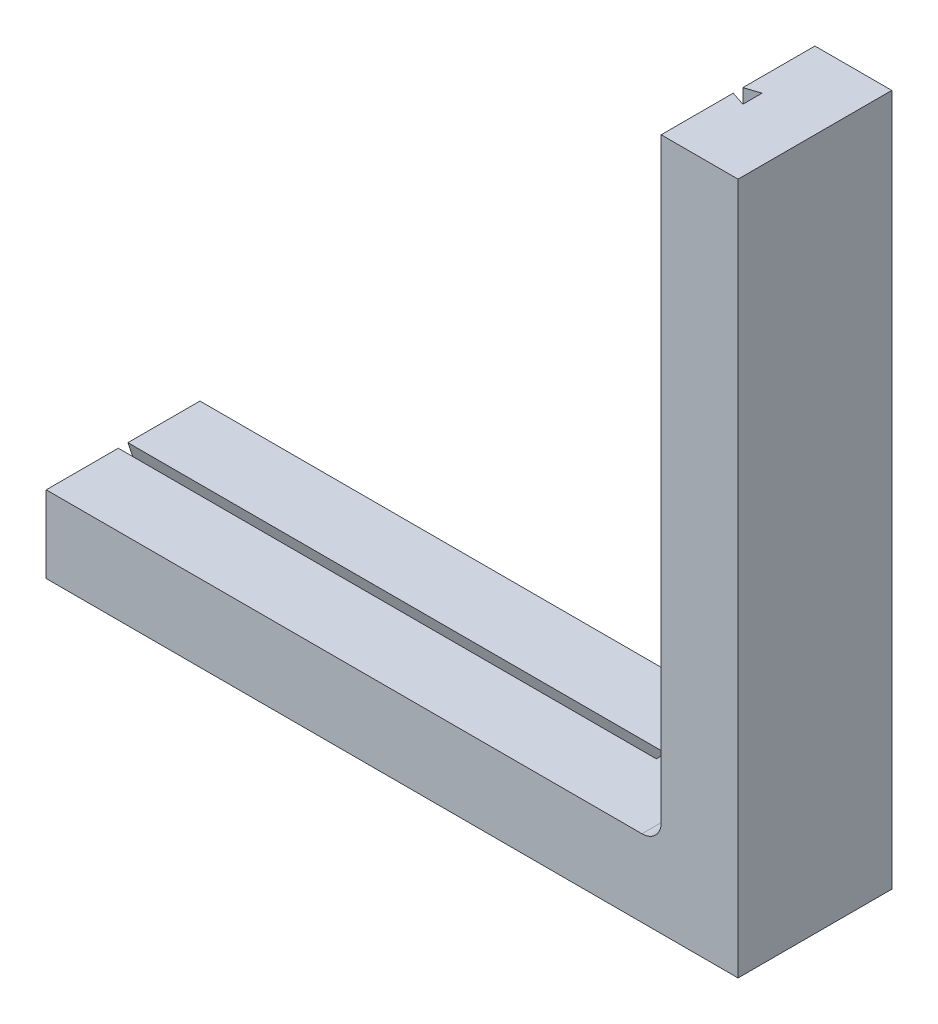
ISO-10303-21;
HEADER;
FILE_DESCRIPTION(('STEP AP214'),'2;1');
FILE_NAME('part.step','',(''),(''),'','','');
FILE_SCHEMA(('AUTOMOTIVE_DESIGN { 1 0 10303 214 1 1 1 1 }'));
ENDSEC;
DATA;
#1=APPLICATION_CONTEXT('core data for automotive mechanical design processes');
#2=APPLICATION_PROTOCOL_DEFINITION('international standard','automotive_design',2000,#1);
#3=PRODUCT_CONTEXT('',#1,'mechanical');
#4=PRODUCT('Part','Part','',(#3));
#5=PRODUCT_RELATED_PRODUCT_CATEGORY('part','',(#4));
#6=PRODUCT_DEFINITION_FORMATION('','',#4);
#7=PRODUCT_DEFINITION_CONTEXT('part definition',#1,'design');
#8=PRODUCT_DEFINITION('design','',#6,#7);
#9=PRODUCT_DEFINITION_SHAPE('','',#8);
#10=(LENGTH_UNIT() NAMED_UNIT(*) SI_UNIT(.MILLI.,.METRE.));
#11=(NAMED_UNIT(*) PLANE_ANGLE_UNIT() SI_UNIT($,.RADIAN.));
#12=(NAMED_UNIT(*) SI_UNIT($,.STERADIAN.) SOLID_ANGLE_UNIT());
#13=UNCERTAINTY_MEASURE_WITH_UNIT(LENGTH_MEASURE(1.E-05),#10,'distance_accuracy_value','');
#14=(GEOMETRIC_REPRESENTATION_CONTEXT(3) GLOBAL_UNCERTAINTY_ASSIGNED_CONTEXT((#13)) GLOBAL_UNIT_ASSIGNED_CONTEXT((#10,
#11,#12)) REPRESENTATION_CONTEXT('',''));
#15=CARTESIAN_POINT('',(0.,0.,0.));
#16=DIRECTION('',(0.,0.,1.));
#17=DIRECTION('',(1.,0.,0.));
#18=AXIS2_PLACEMENT_3D('',#15,#16,#17);
#19=CARTESIAN_POINT('',(-101.6,0.,101.6));
#20=DIRECTION('',(1.,0.,0.));
#21=DIRECTION('',(0.,0.,-1.));
#22=AXIS2_PLACEMENT_3D('',#19,#20,#21);
#23=PLANE('',#22);
#24=DIRECTION('',(0.,-1.,0.));
#25=VECTOR('',#24,1.);
#26=CARTESIAN_POINT('',(-101.6,0.,-101.6));
#27=LINE('',#26,#25);
#28=CARTESIAN_POINT('',(-101.6,914.4,-101.6));
#29=VERTEX_POINT('',#28);
#30=CARTESIAN_POINT('',(-101.6,126.999999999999,-101.6));
#31=VERTEX_POINT('',#30);
#32=EDGE_CURVE('E166',#29,#31,#27,.T.);
#33=ORIENTED_EDGE('',*,*,#32,.T.);
#34=DIRECTION('',(0.,0.,-1.));
#35=VECTOR('',#34,1.);
#36=CARTESIAN_POINT('',(-101.6,126.999999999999,101.6));
#37=LINE('',#36,#35);
#38=CARTESIAN_POINT('',(-101.6,126.999999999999,101.6));
#39=VERTEX_POINT('',#38);
#40=EDGE_CURVE('E54',#31,#39,#37,.F.);
#41=ORIENTED_EDGE('',*,*,#40,.T.);
#42=DIRECTION('',(0.,-1.,0.));
#43=VECTOR('',#42,1.);
#44=CARTESIAN_POINT('',(-101.6,0.,101.6));
#45=LINE('',#44,#43);
#46=CARTESIAN_POINT('',(-101.6,914.4,101.6));
#47=VERTEX_POINT('',#46);
#48=EDGE_CURVE('E168',#47,#39,#45,.T.);
#49=ORIENTED_EDGE('',*,*,#48,.F.);
#50=DIRECTION('',(0.,0.,-1.));
#51=VECTOR('',#50,1.);
#52=CARTESIAN_POINT('',(-101.6,914.4,101.6));
#53=LINE('',#52,#51);
#54=CARTESIAN_POINT('',(-101.6,914.4,6.35));
#55=VERTEX_POINT('',#54);
#56=EDGE_CURVE('E182',#47,#55,#53,.T.);
#57=ORIENTED_EDGE('',*,*,#56,.T.);
#58=DIRECTION('',(0.,1.,0.));
#59=VECTOR('',#58,1.);
#60=CARTESIAN_POINT('',(-101.6,-31.7499999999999,6.35));
#61=LINE('',#60,#59);
#62=CARTESIAN_POINT('',(-101.6,203.2,6.35));
#63=VERTEX_POINT('',#62);
#64=EDGE_CURVE('E227',#63,#55,#61,.T.);
#65=ORIENTED_EDGE('',*,*,#64,.F.);
#66=DIRECTION('',(0.,0.,-1.));
#67=VECTOR('',#66,1.);
#68=CARTESIAN_POINT('',(-101.6,203.2,6.35));
#69=LINE('',#68,#67);
#70=CARTESIAN_POINT('',(-101.6,203.2,-6.34999999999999));
#71=VERTEX_POINT('',#70);
#72=EDGE_CURVE('E217',#63,#71,#69,.T.);
#73=ORIENTED_EDGE('',*,*,#72,.T.);
#74=DIRECTION('',(0.,1.,0.));
#75=VECTOR('',#74,1.);
#76=CARTESIAN_POINT('',(-101.6,-31.7499999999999,-6.35));
#77=LINE('',#76,#75);
#78=CARTESIAN_POINT('',(-101.6,914.4,-6.35));
#79=VERTEX_POINT('',#78);
#80=EDGE_CURVE('E215',#71,#79,#77,.T.);
#81=ORIENTED_EDGE('',*,*,#80,.T.);
#82=EDGE_CURVE('E177',#79,#29,#53,.T.);
#83=ORIENTED_EDGE('',*,*,#82,.T.);
#84=EDGE_LOOP('',(#33,#41,#49,#57,#65,#73,#81,#83));
#85=FACE_BOUND('',#84,.T.);
#86=ADVANCED_FACE('F33',(#85),#23,.F.);
#87=CARTESIAN_POINT('',(-101.6,0.,101.6));
#88=DIRECTION('',(0.,0.,-1.));
#89=DIRECTION('',(-1.,0.,0.));
#90=AXIS2_PLACEMENT_3D('',#87,#88,#89);
#91=PLANE('',#90);
#92=ORIENTED_EDGE('',*,*,#48,.T.);
#93=CARTESIAN_POINT('',(-127.,126.999999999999,101.6));
#94=DIRECTION('',(0.,0.,-1.));
#95=DIRECTION('',(-1.,0.,0.));
#96=AXIS2_PLACEMENT_3D('',#93,#94,#95);
#97=CIRCLE('',#96,25.4);
#98=CARTESIAN_POINT('',(-127.,101.599999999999,101.6));
#99=VERTEX_POINT('',#98);
#100=EDGE_CURVE('E12',#39,#99,#97,.T.);
#101=ORIENTED_EDGE('',*,*,#100,.T.);
#102=DIRECTION('',(1.,0.,0.));
#103=VECTOR('',#102,1.);
#104=CARTESIAN_POINT('',(-1.05914526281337E-12,101.6,101.6));
#105=LINE('',#104,#103);
#106=CARTESIAN_POINT('',(-914.400000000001,101.59999999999,101.6));
#107=VERTEX_POINT('',#106);
#108=EDGE_CURVE('E196',#107,#99,#105,.T.);
#109=ORIENTED_EDGE('',*,*,#108,.F.);
#110=DIRECTION('',(0.,1.,0.));
#111=VECTOR('',#110,1.);
#112=CARTESIAN_POINT('',(-914.4,-9.54276657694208E-12,101.6));
#113=LINE('',#112,#111);
#114=CARTESIAN_POINT('',(-914.4,-9.54276657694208E-12,101.6));
#115=VERTEX_POINT('',#114);
#116=EDGE_CURVE('E158',#115,#107,#113,.T.);
#117=ORIENTED_EDGE('',*,*,#116,.F.);
#118=DIRECTION('',(-1.,0.,0.));
#119=VECTOR('',#118,1.);
#120=CARTESIAN_POINT('',(0.,0.,101.6));
#121=LINE('',#120,#119);
#122=CARTESIAN_POINT('',(0.,0.,101.6));
#123=VERTEX_POINT('',#122);
#124=EDGE_CURVE('E143',#123,#115,#121,.T.);
#125=ORIENTED_EDGE('',*,*,#124,.F.);
#126=DIRECTION('',(0.,1.,0.));
#127=VECTOR('',#126,1.);
#128=CARTESIAN_POINT('',(0.,0.,101.6));
#129=LINE('',#128,#127);
#130=CARTESIAN_POINT('',(0.,914.4,101.6));
#131=VERTEX_POINT('',#130);
#132=EDGE_CURVE('E155',#123,#131,#129,.T.);
#133=ORIENTED_EDGE('',*,*,#132,.T.);
#134=DIRECTION('',(-1.,0.,0.));
#135=VECTOR('',#134,1.);
#136=CARTESIAN_POINT('',(0.,914.4,101.6));
#137=LINE('',#136,#135);
#138=EDGE_CURVE('E165',#131,#47,#137,.T.);
#139=ORIENTED_EDGE('',*,*,#138,.T.);
#140=EDGE_LOOP('',(#92,#101,#109,#117,#125,#133,#139));
#141=FACE_BOUND('',#140,.T.);
#142=ADVANCED_FACE('F154',(#141),#91,.F.);
#143=CARTESIAN_POINT('',(-101.6,0.,-101.6));
#144=DIRECTION('',(0.,0.,-1.));
#145=DIRECTION('',(-1.,0.,0.));
#146=AXIS2_PLACEMENT_3D('',#143,#144,#145);
#147=PLANE('',#146);
#148=DIRECTION('',(0.,1.,0.));
#149=VECTOR('',#148,1.);
#150=CARTESIAN_POINT('',(0.,0.,-101.6));
#151=LINE('',#150,#149);
#152=CARTESIAN_POINT('',(0.,0.,-101.6));
#153=VERTEX_POINT('',#152);
#154=CARTESIAN_POINT('',(0.,914.4,-101.6));
#155=VERTEX_POINT('',#154);
#156=EDGE_CURVE('E178',#153,#155,#151,.T.);
#157=ORIENTED_EDGE('',*,*,#156,.F.);
#158=DIRECTION('',(-1.,0.,0.));
#159=VECTOR('',#158,1.);
#160=CARTESIAN_POINT('',(0.,0.,-101.6));
#161=LINE('',#160,#159);
#162=CARTESIAN_POINT('',(-914.4,-9.54276657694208E-12,-101.6));
#163=VERTEX_POINT('',#162);
#164=EDGE_CURVE('E146',#153,#163,#161,.T.);
#165=ORIENTED_EDGE('',*,*,#164,.T.);
#166=DIRECTION('',(0.,1.,0.));
#167=VECTOR('',#166,1.);
#168=CARTESIAN_POINT('',(-914.4,-9.54276657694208E-12,-101.6));
#169=LINE('',#168,#167);
#170=CARTESIAN_POINT('',(-914.400000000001,101.59999999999,-101.6));
#171=VERTEX_POINT('',#170);
#172=EDGE_CURVE('E201',#163,#171,#169,.T.);
#173=ORIENTED_EDGE('',*,*,#172,.T.);
#174=DIRECTION('',(1.,0.,0.));
#175=VECTOR('',#174,1.);
#176=CARTESIAN_POINT('',(-1.05914526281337E-12,101.6,-101.6));
#177=LINE('',#176,#175);
#178=CARTESIAN_POINT('',(-127.,101.599999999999,-101.6));
#179=VERTEX_POINT('',#178);
#180=EDGE_CURVE('E159',#171,#179,#177,.T.);
#181=ORIENTED_EDGE('',*,*,#180,.T.);
#182=CARTESIAN_POINT('',(-127.,126.999999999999,-101.6));
#183=DIRECTION('',(0.,0.,-1.));
#184=DIRECTION('',(-1.,0.,0.));
#185=AXIS2_PLACEMENT_3D('',#182,#183,#184);
#186=CIRCLE('',#185,25.4);
#187=EDGE_CURVE('E41',#179,#31,#186,.F.);
#188=ORIENTED_EDGE('',*,*,#187,.T.);
#189=ORIENTED_EDGE('',*,*,#32,.F.);
#190=DIRECTION('',(-1.,0.,0.));
#191=VECTOR('',#190,1.);
#192=CARTESIAN_POINT('',(0.,914.4,-101.6));
#193=LINE('',#192,#191);
#194=EDGE_CURVE('E170',#155,#29,#193,.T.);
#195=ORIENTED_EDGE('',*,*,#194,.F.);
#196=EDGE_LOOP('',(#157,#165,#173,#181,#188,#189,#195));
#197=FACE_BOUND('',#196,.T.);
#198=ADVANCED_FACE('F199',(#197),#147,.T.);
#199=CARTESIAN_POINT('',(0.,0.,101.6));
#200=DIRECTION('',(-1.,0.,0.));
#201=DIRECTION('',(0.,0.,1.));
#202=AXIS2_PLACEMENT_3D('',#199,#200,#201);
#203=PLANE('',#202);
#204=ORIENTED_EDGE('',*,*,#156,.T.);
#205=DIRECTION('',(0.,0.,-1.));
#206=VECTOR('',#205,1.);
#207=CARTESIAN_POINT('',(0.,914.4,101.6));
#208=LINE('',#207,#206);
#209=EDGE_CURVE('E163',#131,#155,#208,.T.);
#210=ORIENTED_EDGE('',*,*,#209,.F.);
#211=ORIENTED_EDGE('',*,*,#132,.F.);
#212=DIRECTION('',(0.,0.,-1.));
#213=VECTOR('',#212,1.);
#214=CARTESIAN_POINT('',(0.,0.,101.6));
#215=LINE('',#214,#213);
#216=EDGE_CURVE('E140',#123,#153,#215,.T.);
#217=ORIENTED_EDGE('',*,*,#216,.T.);
#218=EDGE_LOOP('',(#204,#210,#211,#217));
#219=FACE_BOUND('',#218,.T.);
#220=ADVANCED_FACE('F161',(#219),#203,.F.);
#221=CARTESIAN_POINT('',(0.,914.4,101.6));
#222=DIRECTION('',(0.,-1.,0.));
#223=DIRECTION('',(0.,0.,-1.));
#224=AXIS2_PLACEMENT_3D('',#221,#222,#223);
#225=PLANE('',#224);
#226=ORIENTED_EDGE('',*,*,#82,.F.);
#227=DIRECTION('',(-0.948683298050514,0.,0.316227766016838));
#228=VECTOR('',#227,1.);
#229=CARTESIAN_POINT('',(-101.6,914.4,-6.35));
#230=LINE('',#229,#228);
#231=CARTESIAN_POINT('',(-82.55,914.4,-12.7));
#232=VERTEX_POINT('',#231);
#233=EDGE_CURVE('E225',#232,#79,#230,.T.);
#234=ORIENTED_EDGE('',*,*,#233,.F.);
#235=DIRECTION('',(0.,0.,-1.));
#236=VECTOR('',#235,1.);
#237=CARTESIAN_POINT('',(-82.55,914.4,-12.7));
#238=LINE('',#237,#236);
#239=CARTESIAN_POINT('',(-82.55,914.4,12.7));
#240=VERTEX_POINT('',#239);
#241=EDGE_CURVE('E222',#240,#232,#238,.T.);
#242=ORIENTED_EDGE('',*,*,#241,.F.);
#243=DIRECTION('',(0.948683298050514,0.,0.316227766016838));
#244=VECTOR('',#243,1.);
#245=CARTESIAN_POINT('',(-101.6,914.4,6.35));
#246=LINE('',#245,#244);
#247=EDGE_CURVE('E150',#55,#240,#246,.T.);
#248=ORIENTED_EDGE('',*,*,#247,.F.);
#249=ORIENTED_EDGE('',*,*,#56,.F.);
#250=ORIENTED_EDGE('',*,*,#138,.F.);
#251=ORIENTED_EDGE('',*,*,#209,.T.);
#252=ORIENTED_EDGE('',*,*,#194,.T.);
#253=EDGE_LOOP('',(#226,#234,#242,#248,#249,#250,#251,#252));
#254=FACE_BOUND('',#253,.T.);
#255=ADVANCED_FACE('F244',(#254),#225,.F.);
#256=CARTESIAN_POINT('',(-101.6,-31.7499999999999,-6.35));
#257=DIRECTION('',(-0.316227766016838,0.,-0.948683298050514));
#258=DIRECTION('',(-0.948683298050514,0.,0.316227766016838));
#259=AXIS2_PLACEMENT_3D('',#256,#257,#258);
#260=PLANE('',#259);
#261=DIRECTION('',(0.948683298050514,0.,-0.316227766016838));
#262=VECTOR('',#261,1.);
#263=CARTESIAN_POINT('',(-101.6,203.2,-6.34999999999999));
#264=LINE('',#263,#262);
#265=CARTESIAN_POINT('',(-82.55,203.2,-12.7));
#266=VERTEX_POINT('',#265);
#267=EDGE_CURVE('E214',#71,#266,#264,.T.);
#268=ORIENTED_EDGE('',*,*,#267,.T.);
#269=DIRECTION('',(0.,1.,0.));
#270=VECTOR('',#269,1.);
#271=CARTESIAN_POINT('',(-82.55,-31.7499999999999,-12.7));
#272=LINE('',#271,#270);
#273=EDGE_CURVE('E230',#266,#232,#272,.T.);
#274=ORIENTED_EDGE('',*,*,#273,.T.);
#275=ORIENTED_EDGE('',*,*,#233,.T.);
#276=ORIENTED_EDGE('',*,*,#80,.F.);
#277=EDGE_LOOP('',(#268,#274,#275,#276));
#278=FACE_BOUND('',#277,.T.);
#279=ADVANCED_FACE('F263',(#278),#260,.F.);
#280=CARTESIAN_POINT('',(-82.55,-31.7499999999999,-12.7));
#281=DIRECTION('',(1.,0.,0.));
#282=DIRECTION('',(0.,0.,-1.));
#283=AXIS2_PLACEMENT_3D('',#280,#281,#282);
#284=PLANE('',#283);
#285=DIRECTION('',(0.,0.,1.));
#286=VECTOR('',#285,1.);
#287=CARTESIAN_POINT('',(-82.55,203.2,-12.7));
#288=LINE('',#287,#286);
#289=CARTESIAN_POINT('',(-82.55,203.2,12.7));
#290=VERTEX_POINT('',#289);
#291=EDGE_CURVE('E212',#266,#290,#288,.T.);
#292=ORIENTED_EDGE('',*,*,#291,.T.);
#293=DIRECTION('',(0.,1.,0.));
#294=VECTOR('',#293,1.);
#295=CARTESIAN_POINT('',(-82.55,-31.7499999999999,12.7));
#296=LINE('',#295,#294);
#297=EDGE_CURVE('E232',#290,#240,#296,.T.);
#298=ORIENTED_EDGE('',*,*,#297,.T.);
#299=ORIENTED_EDGE('',*,*,#241,.T.);
#300=ORIENTED_EDGE('',*,*,#273,.F.);
#301=EDGE_LOOP('',(#292,#298,#299,#300));
#302=FACE_BOUND('',#301,.T.);
#303=ADVANCED_FACE('F349',(#302),#284,.F.);
#304=CARTESIAN_POINT('',(-101.6,-31.7499999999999,6.35));
#305=DIRECTION('',(-0.316227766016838,0.,0.948683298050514));
#306=DIRECTION('',(0.948683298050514,0.,0.316227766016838));
#307=AXIS2_PLACEMENT_3D('',#304,#305,#306);
#308=PLANE('',#307);
#309=DIRECTION('',(-0.948683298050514,0.,-0.316227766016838));
#310=VECTOR('',#309,1.);
#311=CARTESIAN_POINT('',(-101.6,203.2,6.34999999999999));
#312=LINE('',#311,#310);
#313=EDGE_CURVE('E173',#290,#63,#312,.T.);
#314=ORIENTED_EDGE('',*,*,#313,.T.);
#315=ORIENTED_EDGE('',*,*,#64,.T.);
#316=ORIENTED_EDGE('',*,*,#247,.T.);
#317=ORIENTED_EDGE('',*,*,#297,.F.);
#318=EDGE_LOOP('',(#314,#315,#316,#317));
#319=FACE_BOUND('',#318,.T.);
#320=ADVANCED_FACE('F236',(#319),#308,.F.);
#321=CARTESIAN_POINT('',(0.,203.2,101.6));
#322=DIRECTION('',(0.,1.,0.));
#323=DIRECTION('',(-1.,0.,0.));
#324=AXIS2_PLACEMENT_3D('',#321,#322,#323);
#325=PLANE('',#324);
#326=ORIENTED_EDGE('',*,*,#72,.F.);
#327=ORIENTED_EDGE('',*,*,#313,.F.);
#328=ORIENTED_EDGE('',*,*,#291,.F.);
#329=ORIENTED_EDGE('',*,*,#267,.F.);
#330=EDGE_LOOP('',(#326,#327,#328,#329));
#331=FACE_BOUND('',#330,.T.);
#332=ADVANCED_FACE('F372',(#331),#325,.T.);
#333=CARTESIAN_POINT('',(-1.05914526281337E-12,101.6,101.6));
#334=DIRECTION('',(0.,-1.,0.));
#335=DIRECTION('',(0.,0.,-1.));
#336=AXIS2_PLACEMENT_3D('',#333,#334,#335);
#337=PLANE('',#336);
#338=ORIENTED_EDGE('',*,*,#108,.T.);
#339=DIRECTION('',(0.,0.,-1.));
#340=VECTOR('',#339,1.);
#341=CARTESIAN_POINT('',(-127.,101.599999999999,-101.6));
#342=LINE('',#341,#340);
#343=EDGE_CURVE('E186',#99,#179,#342,.T.);
#344=ORIENTED_EDGE('',*,*,#343,.T.);
#345=ORIENTED_EDGE('',*,*,#180,.F.);
#346=DIRECTION('',(0.,0.,-1.));
#347=VECTOR('',#346,1.);
#348=CARTESIAN_POINT('',(-914.400000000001,101.59999999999,101.6));
#349=LINE('',#348,#347);
#350=CARTESIAN_POINT('',(-914.400000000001,101.59999999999,-6.35));
#351=VERTEX_POINT('',#350);
#352=EDGE_CURVE('E210',#351,#171,#349,.T.);
#353=ORIENTED_EDGE('',*,*,#352,.F.);
#354=DIRECTION('',(-1.,0.,0.));
#355=VECTOR('',#354,1.);
#356=CARTESIAN_POINT('',(31.7499999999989,101.6,-6.35));
#357=LINE('',#356,#355);
#358=CARTESIAN_POINT('',(-203.200000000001,101.599999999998,-6.34999999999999));
#359=VERTEX_POINT('',#358);
#360=EDGE_CURVE('E417',#359,#351,#357,.T.);
#361=ORIENTED_EDGE('',*,*,#360,.F.);
#362=DIRECTION('',(0.,0.,-1.));
#363=VECTOR('',#362,1.);
#364=CARTESIAN_POINT('',(-203.200000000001,101.599999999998,6.35));
#365=LINE('',#364,#363);
#366=CARTESIAN_POINT('',(-203.200000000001,101.599999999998,6.35));
#367=VERTEX_POINT('',#366);
#368=EDGE_CURVE('E404',#367,#359,#365,.T.);
#369=ORIENTED_EDGE('',*,*,#368,.F.);
#370=DIRECTION('',(-1.,0.,0.));
#371=VECTOR('',#370,1.);
#372=CARTESIAN_POINT('',(31.7499999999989,101.6,6.35));
#373=LINE('',#372,#371);
#374=CARTESIAN_POINT('',(-914.400000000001,101.59999999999,6.35));
#375=VERTEX_POINT('',#374);
#376=EDGE_CURVE('E409',#367,#375,#373,.T.);
#377=ORIENTED_EDGE('',*,*,#376,.T.);
#378=EDGE_CURVE('E207',#107,#375,#349,.T.);
#379=ORIENTED_EDGE('',*,*,#378,.F.);
#380=EDGE_LOOP('',(#338,#344,#345,#353,#361,#369,#377,#379));
#381=FACE_BOUND('',#380,.T.);
#382=ADVANCED_FACE('F193',(#381),#337,.F.);
#383=CARTESIAN_POINT('',(0.,0.,101.6));
#384=DIRECTION('',(0.,1.,0.));
#385=DIRECTION('',(0.,0.,1.));
#386=AXIS2_PLACEMENT_3D('',#383,#384,#385);
#387=PLANE('',#386);
#388=ORIENTED_EDGE('',*,*,#164,.F.);
#389=ORIENTED_EDGE('',*,*,#216,.F.);
#390=ORIENTED_EDGE('',*,*,#124,.T.);
#391=DIRECTION('',(0.,0.,-1.));
#392=VECTOR('',#391,1.);
#393=CARTESIAN_POINT('',(-914.4,-9.54276657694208E-12,101.6));
#394=LINE('',#393,#392);
#395=EDGE_CURVE('E151',#115,#163,#394,.T.);
#396=ORIENTED_EDGE('',*,*,#395,.T.);
#397=EDGE_LOOP('',(#388,#389,#390,#396));
#398=FACE_BOUND('',#397,.T.);
#399=ADVANCED_FACE('F142',(#398),#387,.F.);
#400=CARTESIAN_POINT('',(-914.4,-9.54276657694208E-12,101.6));
#401=DIRECTION('',(1.,0.,0.));
#402=DIRECTION('',(0.,0.,-1.));
#403=AXIS2_PLACEMENT_3D('',#400,#401,#402);
#404=PLANE('',#403);
#405=ORIENTED_EDGE('',*,*,#352,.T.);
#406=ORIENTED_EDGE('',*,*,#172,.F.);
#407=ORIENTED_EDGE('',*,*,#395,.F.);
#408=ORIENTED_EDGE('',*,*,#116,.T.);
#409=ORIENTED_EDGE('',*,*,#378,.T.);
#410=DIRECTION('',(0.,-0.948683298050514,0.316227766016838));
#411=VECTOR('',#410,1.);
#412=CARTESIAN_POINT('',(-914.400000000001,101.59999999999,6.35));
#413=LINE('',#412,#411);
#414=CARTESIAN_POINT('',(-914.400000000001,82.5499999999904,12.7));
#415=VERTEX_POINT('',#414);
#416=EDGE_CURVE('E425',#375,#415,#413,.T.);
#417=ORIENTED_EDGE('',*,*,#416,.T.);
#418=DIRECTION('',(0.,0.,-1.));
#419=VECTOR('',#418,1.);
#420=CARTESIAN_POINT('',(-914.400000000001,82.5499999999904,-12.7));
#421=LINE('',#420,#419);
#422=CARTESIAN_POINT('',(-914.400000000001,82.5499999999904,-12.7));
#423=VERTEX_POINT('',#422);
#424=EDGE_CURVE('E422',#415,#423,#421,.T.);
#425=ORIENTED_EDGE('',*,*,#424,.T.);
#426=DIRECTION('',(0.,0.948683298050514,0.316227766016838));
#427=VECTOR('',#426,1.);
#428=CARTESIAN_POINT('',(-914.400000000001,101.59999999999,-6.35));
#429=LINE('',#428,#427);
#430=EDGE_CURVE('E413',#423,#351,#429,.T.);
#431=ORIENTED_EDGE('',*,*,#430,.T.);
#432=EDGE_LOOP('',(#405,#406,#407,#408,#409,#417,#425,#431));
#433=FACE_BOUND('',#432,.T.);
#434=ADVANCED_FACE('F318',(#433),#404,.F.);
#435=CARTESIAN_POINT('',(31.7499999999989,101.6,-6.35));
#436=DIRECTION('',(0.,0.316227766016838,-0.948683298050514));
#437=DIRECTION('',(0.,0.948683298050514,0.316227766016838));
#438=AXIS2_PLACEMENT_3D('',#435,#436,#437);
#439=PLANE('',#438);
#440=DIRECTION('',(0.,-0.948683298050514,-0.316227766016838));
#441=VECTOR('',#440,1.);
#442=CARTESIAN_POINT('',(-203.200000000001,101.599999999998,-6.34999999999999));
#443=LINE('',#442,#441);
#444=CARTESIAN_POINT('',(-203.200000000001,82.5499999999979,-12.7));
#445=VERTEX_POINT('',#444);
#446=EDGE_CURVE('E430',#359,#445,#443,.T.);
#447=ORIENTED_EDGE('',*,*,#446,.F.);
#448=ORIENTED_EDGE('',*,*,#360,.T.);
#449=ORIENTED_EDGE('',*,*,#430,.F.);
#450=DIRECTION('',(-1.,0.,0.));
#451=VECTOR('',#450,1.);
#452=CARTESIAN_POINT('',(31.7499999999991,82.5500000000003,-12.7));
#453=LINE('',#452,#451);
#454=EDGE_CURVE('E415',#445,#423,#453,.T.);
#455=ORIENTED_EDGE('',*,*,#454,.F.);
#456=EDGE_LOOP('',(#447,#448,#449,#455));
#457=FACE_BOUND('',#456,.T.);
#458=ADVANCED_FACE('F308',(#457),#439,.F.);
#459=CARTESIAN_POINT('',(31.7499999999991,82.5500000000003,-12.7));
#460=DIRECTION('',(0.,-1.,0.));
#461=DIRECTION('',(0.,0.,-1.));
#462=AXIS2_PLACEMENT_3D('',#459,#460,#461);
#463=PLANE('',#462);
#464=DIRECTION('',(0.,0.,1.));
#465=VECTOR('',#464,1.);
#466=CARTESIAN_POINT('',(-203.200000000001,82.5499999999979,-12.7));
#467=LINE('',#466,#465);
#468=CARTESIAN_POINT('',(-203.200000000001,82.5499999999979,12.7));
#469=VERTEX_POINT('',#468);
#470=EDGE_CURVE('E420',#445,#469,#467,.T.);
#471=ORIENTED_EDGE('',*,*,#470,.F.);
#472=ORIENTED_EDGE('',*,*,#454,.T.);
#473=ORIENTED_EDGE('',*,*,#424,.F.);
#474=DIRECTION('',(-1.,0.,0.));
#475=VECTOR('',#474,1.);
#476=CARTESIAN_POINT('',(31.7499999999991,82.5500000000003,12.7));
#477=LINE('',#476,#475);
#478=EDGE_CURVE('E412',#469,#415,#477,.T.);
#479=ORIENTED_EDGE('',*,*,#478,.F.);
#480=EDGE_LOOP('',(#471,#472,#473,#479));
#481=FACE_BOUND('',#480,.T.);
#482=ADVANCED_FACE('F298',(#481),#463,.F.);
#483=CARTESIAN_POINT('',(31.7499999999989,101.6,6.35));
#484=DIRECTION('',(0.,0.316227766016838,0.948683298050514));
#485=DIRECTION('',(0.,-0.948683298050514,0.316227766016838));
#486=AXIS2_PLACEMENT_3D('',#483,#484,#485);
#487=PLANE('',#486);
#488=DIRECTION('',(0.,0.948683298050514,-0.316227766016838));
#489=VECTOR('',#488,1.);
#490=CARTESIAN_POINT('',(-203.200000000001,101.599999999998,6.34999999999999));
#491=LINE('',#490,#489);
#492=EDGE_CURVE('E403',#469,#367,#491,.T.);
#493=ORIENTED_EDGE('',*,*,#492,.F.);
#494=ORIENTED_EDGE('',*,*,#478,.T.);
#495=ORIENTED_EDGE('',*,*,#416,.F.);
#496=ORIENTED_EDGE('',*,*,#376,.F.);
#497=EDGE_LOOP('',(#493,#494,#495,#496));
#498=FACE_BOUND('',#497,.T.);
#499=ADVANCED_FACE('F251',(#498),#487,.F.);
#500=CARTESIAN_POINT('',(-203.2,-2.09573079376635E-12,101.6));
#501=DIRECTION('',(-1.,0.,0.));
#502=DIRECTION('',(0.,1.,0.));
#503=AXIS2_PLACEMENT_3D('',#500,#501,#502);
#504=PLANE('',#503);
#505=ORIENTED_EDGE('',*,*,#368,.T.);
#506=ORIENTED_EDGE('',*,*,#446,.T.);
#507=ORIENTED_EDGE('',*,*,#470,.T.);
#508=ORIENTED_EDGE('',*,*,#492,.T.);
#509=EDGE_LOOP('',(#505,#506,#507,#508));
#510=FACE_BOUND('',#509,.T.);
#511=ADVANCED_FACE('F247',(#510),#504,.T.);
#512=CARTESIAN_POINT('',(-127.,126.999999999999,101.6));
#513=DIRECTION('',(0.,0.,1.));
#514=DIRECTION('',(1.,0.,0.));
#515=AXIS2_PLACEMENT_3D('',#512,#513,#514);
#516=CYLINDRICAL_SURFACE('',#515,25.4);
#517=ORIENTED_EDGE('',*,*,#100,.F.);
#518=ORIENTED_EDGE('',*,*,#40,.F.);
#519=ORIENTED_EDGE('',*,*,#187,.F.);
#520=ORIENTED_EDGE('',*,*,#343,.F.);
#521=EDGE_LOOP('',(#517,#518,#519,#520));
#522=FACE_BOUND('',#521,.T.);
#523=ADVANCED_FACE('F35',(#522),#516,.F.);
#524=CLOSED_SHELL('',(#86,#142,#198,#220,#255,#279,#303,#320,#332,#382,#399,#434,#458,#482,#499,
#511,#523));
#525=MANIFOLD_SOLID_BREP('B2',#524);
#526=ADVANCED_BREP_SHAPE_REPRESENTATION('',(#18,#525),#14);
#527=SHAPE_DEFINITION_REPRESENTATION(#9,#526);
ENDSEC;
END-ISO-10303-21;
